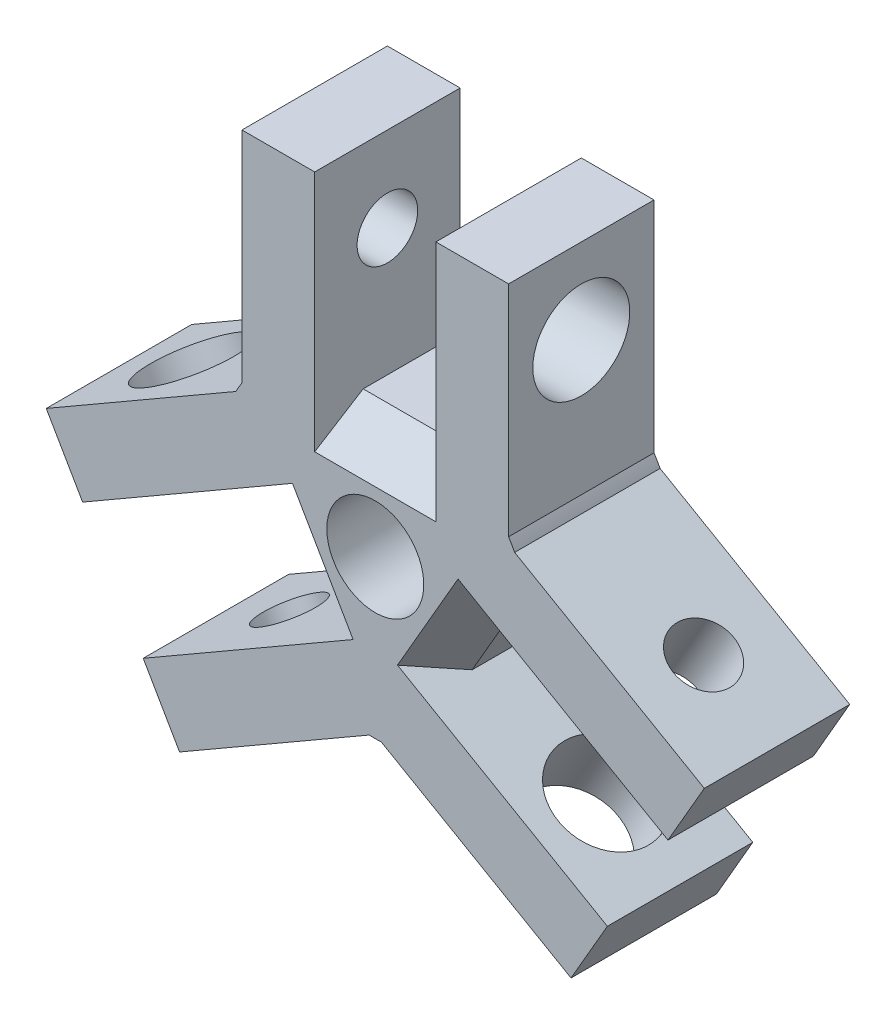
ISO-10303-21;
HEADER;
FILE_DESCRIPTION(('STEP AP214'),'2;1');
FILE_NAME('part.step','',(''),(''),'','','');
FILE_SCHEMA(('AUTOMOTIVE_DESIGN { 1 0 10303 214 1 1 1 1 }'));
ENDSEC;
DATA;
#1=APPLICATION_CONTEXT('core data for automotive mechanical design processes');
#2=APPLICATION_PROTOCOL_DEFINITION('international standard','automotive_design',2000,#1);
#3=PRODUCT_CONTEXT('',#1,'mechanical');
#4=PRODUCT('Part','Part','',(#3));
#5=PRODUCT_RELATED_PRODUCT_CATEGORY('part','',(#4));
#6=PRODUCT_DEFINITION_FORMATION('','',#4);
#7=PRODUCT_DEFINITION_CONTEXT('part definition',#1,'design');
#8=PRODUCT_DEFINITION('design','',#6,#7);
#9=PRODUCT_DEFINITION_SHAPE('','',#8);
#10=(LENGTH_UNIT() NAMED_UNIT(*) SI_UNIT(.MILLI.,.METRE.));
#11=(NAMED_UNIT(*) PLANE_ANGLE_UNIT() SI_UNIT($,.RADIAN.));
#12=(NAMED_UNIT(*) SI_UNIT($,.STERADIAN.) SOLID_ANGLE_UNIT());
#13=UNCERTAINTY_MEASURE_WITH_UNIT(LENGTH_MEASURE(1.E-05),#10,'distance_accuracy_value','');
#14=(GEOMETRIC_REPRESENTATION_CONTEXT(3) GLOBAL_UNCERTAINTY_ASSIGNED_CONTEXT((#13)) GLOBAL_UNIT_ASSIGNED_CONTEXT((#10,
#11,#12)) REPRESENTATION_CONTEXT('',''));
#15=CARTESIAN_POINT('',(0.,0.,0.));
#16=DIRECTION('',(0.,0.,1.));
#17=DIRECTION('',(1.,0.,0.));
#18=AXIS2_PLACEMENT_3D('',#15,#16,#17);
#19=CARTESIAN_POINT('',(0.,0.,6.));
#20=DIRECTION('',(0.,0.,1.));
#21=DIRECTION('',(1.,0.,0.));
#22=AXIS2_PLACEMENT_3D('',#19,#20,#21);
#23=PLANE('',#22);
#24=DIRECTION('',(-0.866025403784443,-0.499999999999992,0.));
#25=VECTOR('',#24,1.);
#26=CARTESIAN_POINT('',(-12.0753175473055,-4.08493649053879,6.));
#27=LINE('',#26,#25);
#28=CARTESIAN_POINT('',(-3.41506350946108,0.915063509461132,6.));
#29=VERTEX_POINT('',#28);
#30=CARTESIAN_POINT('',(-12.0753175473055,-4.08493649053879,6.));
#31=VERTEX_POINT('',#30);
#32=EDGE_CURVE('E53',#29,#31,#27,.T.);
#33=ORIENTED_EDGE('',*,*,#32,.F.);
#34=DIRECTION('',(0.499999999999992,-0.866025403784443,0.));
#35=VECTOR('',#34,1.);
#36=CARTESIAN_POINT('',(-2.1650635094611,-1.24999999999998,6.));
#37=LINE('',#36,#35);
#38=CARTESIAN_POINT('',(-0.915063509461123,-3.41506350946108,6.));
#39=VERTEX_POINT('',#38);
#40=EDGE_CURVE('E428',#29,#39,#37,.T.);
#41=ORIENTED_EDGE('',*,*,#40,.T.);
#42=DIRECTION('',(0.866025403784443,0.499999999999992,0.));
#43=VECTOR('',#42,1.);
#44=CARTESIAN_POINT('',(-9.57531754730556,-8.41506350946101,6.));
#45=LINE('',#44,#43);
#46=CARTESIAN_POINT('',(-9.57531754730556,-8.41506350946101,6.));
#47=VERTEX_POINT('',#46);
#48=EDGE_CURVE('E60',#47,#39,#45,.T.);
#49=ORIENTED_EDGE('',*,*,#48,.F.);
#50=DIRECTION('',(0.499999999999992,-0.866025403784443,0.));
#51=VECTOR('',#50,1.);
#52=CARTESIAN_POINT('',(-8.07531754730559,-11.0131397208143,6.));
#53=LINE('',#52,#51);
#54=CARTESIAN_POINT('',(-8.07531754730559,-11.0131397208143,6.));
#55=VERTEX_POINT('',#54);
#56=EDGE_CURVE('E280',#47,#55,#53,.T.);
#57=ORIENTED_EDGE('',*,*,#56,.T.);
#58=DIRECTION('',(0.866025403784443,0.499999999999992,0.));
#59=VECTOR('',#58,1.);
#60=CARTESIAN_POINT('',(-0.250000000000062,-6.49519052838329,6.));
#61=LINE('',#60,#59);
#62=CARTESIAN_POINT('',(-0.250000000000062,-6.49519052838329,6.));
#63=VERTEX_POINT('',#62);
#64=EDGE_CURVE('E293',#55,#63,#61,.T.);
#65=ORIENTED_EDGE('',*,*,#64,.T.);
#66=CARTESIAN_POINT('',(0.,0.,6.));
#67=DIRECTION('',(0.,0.,1.));
#68=DIRECTION('',(1.,0.,0.));
#69=AXIS2_PLACEMENT_3D('',#66,#67,#68);
#70=CIRCLE('',#69,6.5);
#71=CARTESIAN_POINT('',(0.249999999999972,-6.49519052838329,6.));
#72=VERTEX_POINT('',#71);
#73=EDGE_CURVE('E402',#63,#72,#70,.T.);
#74=ORIENTED_EDGE('',*,*,#73,.T.);
#75=DIRECTION('',(0.866025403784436,-0.500000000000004,0.));
#76=VECTOR('',#75,1.);
#77=CARTESIAN_POINT('',(0.249999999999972,-6.49519052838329,6.));
#78=LINE('',#77,#76);
#79=CARTESIAN_POINT('',(8.07531754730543,-11.0131397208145,6.));
#80=VERTEX_POINT('',#79);
#81=EDGE_CURVE('E316',#72,#80,#78,.T.);
#82=ORIENTED_EDGE('',*,*,#81,.T.);
#83=DIRECTION('',(0.500000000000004,0.866025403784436,0.));
#84=VECTOR('',#83,1.);
#85=CARTESIAN_POINT('',(13.5753175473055,-1.48686027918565,6.));
#86=LINE('',#85,#84);
#87=CARTESIAN_POINT('',(9.57531754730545,-8.41506350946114,6.));
#88=VERTEX_POINT('',#87);
#89=EDGE_CURVE('E322',#80,#88,#86,.T.);
#90=ORIENTED_EDGE('',*,*,#89,.T.);
#91=DIRECTION('',(0.866025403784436,-0.500000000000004,0.));
#92=VECTOR('',#91,1.);
#93=CARTESIAN_POINT('',(9.57531754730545,-8.41506350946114,6.));
#94=LINE('',#93,#92);
#95=CARTESIAN_POINT('',(0.915063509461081,-3.4150635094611,6.));
#96=VERTEX_POINT('',#95);
#97=EDGE_CURVE('E265',#96,#88,#94,.T.);
#98=ORIENTED_EDGE('',*,*,#97,.F.);
#99=DIRECTION('',(0.500000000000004,0.866025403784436,0.));
#100=VECTOR('',#99,1.);
#101=CARTESIAN_POINT('',(2.16506350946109,-1.25000000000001,6.));
#102=LINE('',#101,#100);
#103=CARTESIAN_POINT('',(3.4150635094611,0.915063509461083,6.));
#104=VERTEX_POINT('',#103);
#105=EDGE_CURVE('E418',#96,#104,#102,.T.);
#106=ORIENTED_EDGE('',*,*,#105,.T.);
#107=DIRECTION('',(-0.866025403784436,0.500000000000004,0.));
#108=VECTOR('',#107,1.);
#109=CARTESIAN_POINT('',(12.0753175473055,-4.08493649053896,6.));
#110=LINE('',#109,#108);
#111=CARTESIAN_POINT('',(12.0753175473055,-4.08493649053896,6.));
#112=VERTEX_POINT('',#111);
#113=EDGE_CURVE('E263',#112,#104,#110,.T.);
#114=ORIENTED_EDGE('',*,*,#113,.F.);
#115=CARTESIAN_POINT('',(13.5753175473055,-1.48686027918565,6.));
#116=VERTEX_POINT('',#115);
#117=EDGE_CURVE('E306',#112,#116,#86,.T.);
#118=ORIENTED_EDGE('',*,*,#117,.T.);
#119=DIRECTION('',(-0.866025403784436,0.500000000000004,0.));
#120=VECTOR('',#119,1.);
#121=CARTESIAN_POINT('',(5.75000000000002,3.03108891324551,6.));
#122=LINE('',#121,#120);
#123=CARTESIAN_POINT('',(5.75000000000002,3.03108891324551,6.));
#124=VERTEX_POINT('',#123);
#125=EDGE_CURVE('E320',#116,#124,#122,.T.);
#126=ORIENTED_EDGE('',*,*,#125,.T.);
#127=CARTESIAN_POINT('',(5.5,3.46410161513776,6.));
#128=VERTEX_POINT('',#127);
#129=EDGE_CURVE('E396',#124,#128,#70,.T.);
#130=ORIENTED_EDGE('',*,*,#129,.T.);
#131=DIRECTION('',(0.,1.,0.));
#132=VECTOR('',#131,1.);
#133=CARTESIAN_POINT('',(5.5,3.46410161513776,6.));
#134=LINE('',#133,#132);
#135=CARTESIAN_POINT('',(5.5,12.5,6.));
#136=VERTEX_POINT('',#135);
#137=EDGE_CURVE('E377',#128,#136,#134,.T.);
#138=ORIENTED_EDGE('',*,*,#137,.T.);
#139=DIRECTION('',(-1.,0.,0.));
#140=VECTOR('',#139,1.);
#141=CARTESIAN_POINT('',(-5.5,12.5,6.));
#142=LINE('',#141,#140);
#143=CARTESIAN_POINT('',(2.5,12.5,6.));
#144=VERTEX_POINT('',#143);
#145=EDGE_CURVE('E383',#136,#144,#142,.T.);
#146=ORIENTED_EDGE('',*,*,#145,.T.);
#147=DIRECTION('',(0.,1.,0.));
#148=VECTOR('',#147,1.);
#149=CARTESIAN_POINT('',(2.5,12.5,6.));
#150=LINE('',#149,#148);
#151=CARTESIAN_POINT('',(2.5,2.5,6.));
#152=VERTEX_POINT('',#151);
#153=EDGE_CURVE('E352',#152,#144,#150,.T.);
#154=ORIENTED_EDGE('',*,*,#153,.F.);
#155=DIRECTION('',(-1.,0.,0.));
#156=VECTOR('',#155,1.);
#157=CARTESIAN_POINT('',(0.,2.5,6.));
#158=LINE('',#157,#156);
#159=CARTESIAN_POINT('',(-2.5,2.5,6.));
#160=VERTEX_POINT('',#159);
#161=EDGE_CURVE('E405',#152,#160,#158,.T.);
#162=ORIENTED_EDGE('',*,*,#161,.T.);
#163=DIRECTION('',(0.,-1.,0.));
#164=VECTOR('',#163,1.);
#165=CARTESIAN_POINT('',(-2.5,12.5,6.));
#166=LINE('',#165,#164);
#167=CARTESIAN_POINT('',(-2.5,12.5,6.));
#168=VERTEX_POINT('',#167);
#169=EDGE_CURVE('E350',#168,#160,#166,.T.);
#170=ORIENTED_EDGE('',*,*,#169,.F.);
#171=CARTESIAN_POINT('',(-5.5,12.5,6.));
#172=VERTEX_POINT('',#171);
#173=EDGE_CURVE('E367',#168,#172,#142,.T.);
#174=ORIENTED_EDGE('',*,*,#173,.T.);
#175=DIRECTION('',(0.,-1.,0.));
#176=VECTOR('',#175,1.);
#177=CARTESIAN_POINT('',(-5.5,3.46410161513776,6.));
#178=LINE('',#177,#176);
#179=CARTESIAN_POINT('',(-5.5,3.46410161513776,6.));
#180=VERTEX_POINT('',#179);
#181=EDGE_CURVE('E381',#172,#180,#178,.T.);
#182=ORIENTED_EDGE('',*,*,#181,.T.);
#183=CARTESIAN_POINT('',(-5.74999999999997,3.03108891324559,6.));
#184=VERTEX_POINT('',#183);
#185=EDGE_CURVE('E398',#180,#184,#70,.T.);
#186=ORIENTED_EDGE('',*,*,#185,.T.);
#187=DIRECTION('',(-0.866025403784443,-0.499999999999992,0.));
#188=VECTOR('',#187,1.);
#189=CARTESIAN_POINT('',(-5.74999999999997,3.03108891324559,6.));
#190=LINE('',#189,#188);
#191=CARTESIAN_POINT('',(-13.5753175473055,-1.48686027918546,6.));
#192=VERTEX_POINT('',#191);
#193=EDGE_CURVE('E289',#184,#192,#190,.T.);
#194=ORIENTED_EDGE('',*,*,#193,.T.);
#195=EDGE_CURVE('E295',#192,#31,#53,.T.);
#196=ORIENTED_EDGE('',*,*,#195,.T.);
#197=EDGE_LOOP('',(#33,#41,#49,#57,#65,#74,#82,#90,#98,#106,#114,#118,#126,#130,#138,#146,#154,
#162,#170,#174,#182,#186,#194,#196));
#198=FACE_BOUND('',#197,.T.);
#199=CARTESIAN_POINT('',(0.,0.,6.));
#200=DIRECTION('',(0.,0.,-1.));
#201=DIRECTION('',(-1.,0.,0.));
#202=AXIS2_PLACEMENT_3D('',#199,#200,#201);
#203=CIRCLE('',#202,2.);
#204=CARTESIAN_POINT('',(-2.,0.,6.));
#205=VERTEX_POINT('',#204);
#206=EDGE_CURVE('E895',#205,#205,#203,.T.);
#207=ORIENTED_EDGE('',*,*,#206,.T.);
#208=EDGE_LOOP('',(#207));
#209=FACE_BOUND('',#208,.T.);
#210=ADVANCED_FACE('F36',(#198,#209),#23,.T.);
#211=CARTESIAN_POINT('',(-5.74999999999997,3.03108891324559,25.359866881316));
#212=DIRECTION('',(0.499999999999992,-0.866025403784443,0.));
#213=DIRECTION('',(0.866025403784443,0.499999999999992,0.));
#214=AXIS2_PLACEMENT_3D('',#211,#212,#213);
#215=PLANE('',#214);
#216=ORIENTED_EDGE('',*,*,#193,.F.);
#217=DIRECTION('',(0.,0.,-1.));
#218=VECTOR('',#217,1.);
#219=CARTESIAN_POINT('',(-5.74999999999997,3.03108891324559,25.359866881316));
#220=LINE('',#219,#218);
#221=CARTESIAN_POINT('',(-5.74999999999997,3.03108891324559,0.));
#222=VERTEX_POINT('',#221);
#223=EDGE_CURVE('E285',#184,#222,#220,.T.);
#224=ORIENTED_EDGE('',*,*,#223,.T.);
#225=DIRECTION('',(-0.866025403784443,-0.499999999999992,0.));
#226=VECTOR('',#225,1.);
#227=CARTESIAN_POINT('',(-5.74999999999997,3.03108891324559,0.));
#228=LINE('',#227,#226);
#229=CARTESIAN_POINT('',(-13.5753175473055,-1.48686027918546,0.));
#230=VERTEX_POINT('',#229);
#231=EDGE_CURVE('E281',#222,#230,#228,.T.);
#232=ORIENTED_EDGE('',*,*,#231,.T.);
#233=DIRECTION('',(0.,0.,-1.));
#234=VECTOR('',#233,1.);
#235=CARTESIAN_POINT('',(-13.5753175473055,-1.48686027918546,25.359866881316));
#236=LINE('',#235,#234);
#237=EDGE_CURVE('E284',#192,#230,#236,.T.);
#238=ORIENTED_EDGE('',*,*,#237,.F.);
#239=EDGE_LOOP('',(#216,#224,#232,#238));
#240=FACE_BOUND('',#239,.T.);
#241=CARTESIAN_POINT('',(-10.5442286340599,0.26313972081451,3.));
#242=DIRECTION('',(0.499999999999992,-0.866025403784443,0.));
#243=DIRECTION('',(0.866025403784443,0.499999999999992,0.));
#244=AXIS2_PLACEMENT_3D('',#241,#242,#243);
#245=CIRCLE('',#244,2.);
#246=CARTESIAN_POINT('',(-8.81217782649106,1.26313972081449,3.));
#247=VERTEX_POINT('',#246);
#248=EDGE_CURVE('E433',#247,#247,#245,.F.);
#249=ORIENTED_EDGE('',*,*,#248,.F.);
#250=EDGE_LOOP('',(#249));
#251=FACE_BOUND('',#250,.T.);
#252=ADVANCED_FACE('F520',(#240,#251),#215,.F.);
#253=CARTESIAN_POINT('',(-12.0753175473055,-4.08493649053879,6.));
#254=DIRECTION('',(0.499999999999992,-0.866025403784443,0.));
#255=DIRECTION('',(0.866025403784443,0.499999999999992,0.));
#256=AXIS2_PLACEMENT_3D('',#253,#254,#255);
#257=PLANE('',#256);
#258=DIRECTION('',(-0.866025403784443,-0.499999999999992,0.));
#259=VECTOR('',#258,1.);
#260=CARTESIAN_POINT('',(-12.0753175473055,-4.08493649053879,0.));
#261=LINE('',#260,#259);
#262=CARTESIAN_POINT('',(-4.49759526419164,0.290063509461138,0.));
#263=VERTEX_POINT('',#262);
#264=CARTESIAN_POINT('',(-12.0753175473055,-4.08493649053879,0.));
#265=VERTEX_POINT('',#264);
#266=EDGE_CURVE('E234',#263,#265,#261,.T.);
#267=ORIENTED_EDGE('',*,*,#266,.F.);
#268=DIRECTION('',(0.,0.,-1.));
#269=VECTOR('',#268,1.);
#270=CARTESIAN_POINT('',(-4.49759526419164,0.290063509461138,6.));
#271=LINE('',#270,#269);
#272=CARTESIAN_POINT('',(-4.49759526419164,0.290063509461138,3.99999999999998));
#273=VERTEX_POINT('',#272);
#274=EDGE_CURVE('E225',#273,#263,#271,.T.);
#275=ORIENTED_EDGE('',*,*,#274,.F.);
#276=DIRECTION('',(-0.458992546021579,-0.264999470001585,-0.847998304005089));
#277=VECTOR('',#276,1.);
#278=CARTESIAN_POINT('',(-4.49759526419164,0.290063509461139,3.99999999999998));
#279=LINE('',#278,#277);
#280=EDGE_CURVE('E45',#273,#29,#279,.F.);
#281=ORIENTED_EDGE('',*,*,#280,.T.);
#282=ORIENTED_EDGE('',*,*,#32,.T.);
#283=DIRECTION('',(0.,0.,-1.));
#284=VECTOR('',#283,1.);
#285=CARTESIAN_POINT('',(-12.0753175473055,-4.08493649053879,6.));
#286=LINE('',#285,#284);
#287=EDGE_CURVE('E252',#31,#265,#286,.T.);
#288=ORIENTED_EDGE('',*,*,#287,.T.);
#289=EDGE_LOOP('',(#267,#275,#281,#282,#288));
#290=FACE_BOUND('',#289,.T.);
#291=CARTESIAN_POINT('',(-9.04422863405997,-2.33493649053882,3.));
#292=DIRECTION('',(0.499999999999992,-0.866025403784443,0.));
#293=DIRECTION('',(0.866025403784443,0.499999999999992,0.));
#294=AXIS2_PLACEMENT_3D('',#291,#292,#293);
#295=CIRCLE('',#294,2.);
#296=CARTESIAN_POINT('',(-7.31217782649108,-1.33493649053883,3.));
#297=VERTEX_POINT('',#296);
#298=EDGE_CURVE('E40',#297,#297,#295,.F.);
#299=ORIENTED_EDGE('',*,*,#298,.T.);
#300=EDGE_LOOP('',(#299));
#301=FACE_BOUND('',#300,.T.);
#302=ADVANCED_FACE('F524',(#290,#301),#257,.T.);
#303=CARTESIAN_POINT('',(0.249999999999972,-6.49519052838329,25.359866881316));
#304=DIRECTION('',(0.500000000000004,0.866025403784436,0.));
#305=DIRECTION('',(-0.866025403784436,0.500000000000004,0.));
#306=AXIS2_PLACEMENT_3D('',#303,#304,#305);
#307=PLANE('',#306);
#308=ORIENTED_EDGE('',*,*,#81,.F.);
#309=DIRECTION('',(0.,0.,-1.));
#310=VECTOR('',#309,1.);
#311=CARTESIAN_POINT('',(0.249999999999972,-6.49519052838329,25.359866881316));
#312=LINE('',#311,#310);
#313=CARTESIAN_POINT('',(0.249999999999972,-6.49519052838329,0.));
#314=VERTEX_POINT('',#313);
#315=EDGE_CURVE('E312',#72,#314,#312,.T.);
#316=ORIENTED_EDGE('',*,*,#315,.T.);
#317=DIRECTION('',(0.866025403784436,-0.500000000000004,0.));
#318=VECTOR('',#317,1.);
#319=CARTESIAN_POINT('',(0.249999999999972,-6.49519052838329,0.));
#320=LINE('',#319,#318);
#321=CARTESIAN_POINT('',(8.07531754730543,-11.0131397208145,0.));
#322=VERTEX_POINT('',#321);
#323=EDGE_CURVE('E308',#314,#322,#320,.T.);
#324=ORIENTED_EDGE('',*,*,#323,.T.);
#325=DIRECTION('',(0.,0.,-1.));
#326=VECTOR('',#325,1.);
#327=CARTESIAN_POINT('',(8.07531754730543,-11.0131397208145,25.359866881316));
#328=LINE('',#327,#326);
#329=EDGE_CURVE('E311',#80,#322,#328,.T.);
#330=ORIENTED_EDGE('',*,*,#329,.F.);
#331=EDGE_LOOP('',(#308,#316,#324,#330));
#332=FACE_BOUND('',#331,.T.);
#333=CARTESIAN_POINT('',(5.04422863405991,-9.26313972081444,3.));
#334=DIRECTION('',(0.500000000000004,0.866025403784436,0.));
#335=DIRECTION('',(-0.866025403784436,0.500000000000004,0.));
#336=AXIS2_PLACEMENT_3D('',#333,#334,#335);
#337=CIRCLE('',#336,2.);
#338=CARTESIAN_POINT('',(3.31217782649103,-8.26313972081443,3.));
#339=VERTEX_POINT('',#338);
#340=EDGE_CURVE('E432',#339,#339,#337,.F.);
#341=ORIENTED_EDGE('',*,*,#340,.F.);
#342=EDGE_LOOP('',(#341));
#343=FACE_BOUND('',#342,.T.);
#344=ADVANCED_FACE('F491',(#332,#343),#307,.F.);
#345=CARTESIAN_POINT('',(9.57531754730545,-8.41506350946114,6.));
#346=DIRECTION('',(0.500000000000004,0.866025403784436,0.));
#347=DIRECTION('',(-0.866025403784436,0.500000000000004,0.));
#348=AXIS2_PLACEMENT_3D('',#345,#346,#347);
#349=PLANE('',#348);
#350=DIRECTION('',(0.866025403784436,-0.500000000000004,0.));
#351=VECTOR('',#350,1.);
#352=CARTESIAN_POINT('',(9.57531754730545,-8.41506350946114,0.));
#353=LINE('',#352,#351);
#354=CARTESIAN_POINT('',(1.99759526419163,-4.04006350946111,0.));
#355=VERTEX_POINT('',#354);
#356=CARTESIAN_POINT('',(9.57531754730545,-8.41506350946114,0.));
#357=VERTEX_POINT('',#356);
#358=EDGE_CURVE('E260',#355,#357,#353,.T.);
#359=ORIENTED_EDGE('',*,*,#358,.F.);
#360=DIRECTION('',(0.,0.,-1.));
#361=VECTOR('',#360,1.);
#362=CARTESIAN_POINT('',(1.99759526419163,-4.04006350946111,6.));
#363=LINE('',#362,#361);
#364=CARTESIAN_POINT('',(1.99759526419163,-4.04006350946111,3.99999999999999));
#365=VERTEX_POINT('',#364);
#366=EDGE_CURVE('E272',#365,#355,#363,.T.);
#367=ORIENTED_EDGE('',*,*,#366,.F.);
#368=DIRECTION('',(0.458992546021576,-0.264999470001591,-0.847998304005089));
#369=VECTOR('',#368,1.);
#370=CARTESIAN_POINT('',(1.99759526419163,-4.04006350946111,3.99999999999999));
#371=LINE('',#370,#369);
#372=EDGE_CURVE('E421',#365,#96,#371,.F.);
#373=ORIENTED_EDGE('',*,*,#372,.T.);
#374=ORIENTED_EDGE('',*,*,#97,.T.);
#375=DIRECTION('',(0.,0.,-1.));
#376=VECTOR('',#375,1.);
#377=CARTESIAN_POINT('',(9.57531754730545,-8.41506350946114,6.));
#378=LINE('',#377,#376);
#379=EDGE_CURVE('E270',#88,#357,#378,.T.);
#380=ORIENTED_EDGE('',*,*,#379,.T.);
#381=EDGE_LOOP('',(#359,#367,#373,#374,#380));
#382=FACE_BOUND('',#381,.T.);
#383=CARTESIAN_POINT('',(6.54422863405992,-6.66506350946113,3.));
#384=DIRECTION('',(0.500000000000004,0.866025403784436,0.));
#385=DIRECTION('',(-0.866025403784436,0.500000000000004,0.));
#386=AXIS2_PLACEMENT_3D('',#383,#384,#385);
#387=CIRCLE('',#386,2.);
#388=CARTESIAN_POINT('',(4.81217782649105,-5.66506350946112,3.));
#389=VERTEX_POINT('',#388);
#390=EDGE_CURVE('E430',#389,#389,#387,.F.);
#391=ORIENTED_EDGE('',*,*,#390,.T.);
#392=EDGE_LOOP('',(#391));
#393=FACE_BOUND('',#392,.T.);
#394=ADVANCED_FACE('F506',(#382,#393),#349,.T.);
#395=CARTESIAN_POINT('',(0.,0.,0.));
#396=DIRECTION('',(0.,0.,1.));
#397=DIRECTION('',(1.,0.,0.));
#398=AXIS2_PLACEMENT_3D('',#395,#396,#397);
#399=PLANE('',#398);
#400=CARTESIAN_POINT('',(0.,0.,0.));
#401=DIRECTION('',(0.,0.,-1.));
#402=DIRECTION('',(-1.,0.,0.));
#403=AXIS2_PLACEMENT_3D('',#400,#401,#402);
#404=CIRCLE('',#403,2.);
#405=CARTESIAN_POINT('',(-2.,0.,0.));
#406=VERTEX_POINT('',#405);
#407=EDGE_CURVE('E444',#406,#406,#404,.T.);
#408=ORIENTED_EDGE('',*,*,#407,.F.);
#409=EDGE_LOOP('',(#408));
#410=FACE_BOUND('',#409,.T.);
#411=DIRECTION('',(0.866025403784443,0.499999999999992,0.));
#412=VECTOR('',#411,1.);
#413=CARTESIAN_POINT('',(-9.57531754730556,-8.41506350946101,0.));
#414=LINE('',#413,#412);
#415=CARTESIAN_POINT('',(-9.57531754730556,-8.41506350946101,0.));
#416=VERTEX_POINT('',#415);
#417=CARTESIAN_POINT('',(-1.99759526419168,-4.04006350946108,0.));
#418=VERTEX_POINT('',#417);
#419=EDGE_CURVE('E218',#416,#418,#414,.T.);
#420=ORIENTED_EDGE('',*,*,#419,.T.);
#421=DIRECTION('',(-0.499999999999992,0.866025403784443,0.));
#422=VECTOR('',#421,1.);
#423=CARTESIAN_POINT('',(-1.99759526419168,-4.04006350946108,0.));
#424=LINE('',#423,#422);
#425=EDGE_CURVE('E228',#418,#263,#424,.T.);
#426=ORIENTED_EDGE('',*,*,#425,.T.);
#427=ORIENTED_EDGE('',*,*,#266,.T.);
#428=DIRECTION('',(0.499999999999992,-0.866025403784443,0.));
#429=VECTOR('',#428,1.);
#430=CARTESIAN_POINT('',(-8.07531754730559,-11.0131397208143,0.));
#431=LINE('',#430,#429);
#432=EDGE_CURVE('E277',#230,#265,#431,.T.);
#433=ORIENTED_EDGE('',*,*,#432,.F.);
#434=ORIENTED_EDGE('',*,*,#231,.F.);
#435=CARTESIAN_POINT('',(0.,0.,0.));
#436=DIRECTION('',(0.,0.,1.));
#437=DIRECTION('',(1.,0.,0.));
#438=AXIS2_PLACEMENT_3D('',#435,#436,#437);
#439=CIRCLE('',#438,6.5);
#440=CARTESIAN_POINT('',(-5.5,3.46410161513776,0.));
#441=VERTEX_POINT('',#440);
#442=EDGE_CURVE('E393',#441,#222,#439,.T.);
#443=ORIENTED_EDGE('',*,*,#442,.F.);
#444=DIRECTION('',(0.,-1.,0.));
#445=VECTOR('',#444,1.);
#446=CARTESIAN_POINT('',(-5.5,3.46410161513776,0.));
#447=LINE('',#446,#445);
#448=CARTESIAN_POINT('',(-5.5,12.5,0.));
#449=VERTEX_POINT('',#448);
#450=EDGE_CURVE('E374',#449,#441,#447,.T.);
#451=ORIENTED_EDGE('',*,*,#450,.F.);
#452=DIRECTION('',(-1.,0.,0.));
#453=VECTOR('',#452,1.);
#454=CARTESIAN_POINT('',(-5.5,12.5,0.));
#455=LINE('',#454,#453);
#456=CARTESIAN_POINT('',(-2.5,12.5,0.));
#457=VERTEX_POINT('',#456);
#458=EDGE_CURVE('E368',#457,#449,#455,.T.);
#459=ORIENTED_EDGE('',*,*,#458,.F.);
#460=DIRECTION('',(0.,-1.,0.));
#461=VECTOR('',#460,1.);
#462=CARTESIAN_POINT('',(-2.5,12.5,0.));
#463=LINE('',#462,#461);
#464=CARTESIAN_POINT('',(-2.5,3.75,0.));
#465=VERTEX_POINT('',#464);
#466=EDGE_CURVE('E341',#457,#465,#463,.T.);
#467=ORIENTED_EDGE('',*,*,#466,.T.);
#468=DIRECTION('',(1.,0.,0.));
#469=VECTOR('',#468,1.);
#470=CARTESIAN_POINT('',(-2.5,3.75,0.));
#471=LINE('',#470,#469);
#472=CARTESIAN_POINT('',(2.5,3.75,0.));
#473=VERTEX_POINT('',#472);
#474=EDGE_CURVE('E344',#465,#473,#471,.T.);
#475=ORIENTED_EDGE('',*,*,#474,.T.);
#476=DIRECTION('',(0.,1.,0.));
#477=VECTOR('',#476,1.);
#478=CARTESIAN_POINT('',(2.5,12.5,0.));
#479=LINE('',#478,#477);
#480=CARTESIAN_POINT('',(2.5,12.5,0.));
#481=VERTEX_POINT('',#480);
#482=EDGE_CURVE('E347',#473,#481,#479,.T.);
#483=ORIENTED_EDGE('',*,*,#482,.T.);
#484=CARTESIAN_POINT('',(5.5,12.5,0.));
#485=VERTEX_POINT('',#484);
#486=EDGE_CURVE('E364',#485,#481,#455,.T.);
#487=ORIENTED_EDGE('',*,*,#486,.F.);
#488=DIRECTION('',(0.,1.,0.));
#489=VECTOR('',#488,1.);
#490=CARTESIAN_POINT('',(5.5,3.46410161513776,0.));
#491=LINE('',#490,#489);
#492=CARTESIAN_POINT('',(5.5,3.46410161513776,0.));
#493=VERTEX_POINT('',#492);
#494=EDGE_CURVE('E369',#493,#485,#491,.T.);
#495=ORIENTED_EDGE('',*,*,#494,.F.);
#496=CARTESIAN_POINT('',(5.75000000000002,3.03108891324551,0.));
#497=VERTEX_POINT('',#496);
#498=EDGE_CURVE('E380',#497,#493,#439,.T.);
#499=ORIENTED_EDGE('',*,*,#498,.F.);
#500=DIRECTION('',(-0.866025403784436,0.500000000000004,0.));
#501=VECTOR('',#500,1.);
#502=CARTESIAN_POINT('',(5.75000000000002,3.03108891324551,0.));
#503=LINE('',#502,#501);
#504=CARTESIAN_POINT('',(13.5753175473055,-1.48686027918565,0.));
#505=VERTEX_POINT('',#504);
#506=EDGE_CURVE('E313',#505,#497,#503,.T.);
#507=ORIENTED_EDGE('',*,*,#506,.F.);
#508=DIRECTION('',(0.500000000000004,0.866025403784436,0.));
#509=VECTOR('',#508,1.);
#510=CARTESIAN_POINT('',(13.5753175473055,-1.48686027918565,0.));
#511=LINE('',#510,#509);
#512=CARTESIAN_POINT('',(12.0753175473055,-4.08493649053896,0.));
#513=VERTEX_POINT('',#512);
#514=EDGE_CURVE('E307',#513,#505,#511,.T.);
#515=ORIENTED_EDGE('',*,*,#514,.F.);
#516=DIRECTION('',(-0.866025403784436,0.500000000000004,0.));
#517=VECTOR('',#516,1.);
#518=CARTESIAN_POINT('',(12.0753175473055,-4.08493649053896,0.));
#519=LINE('',#518,#517);
#520=CARTESIAN_POINT('',(4.49759526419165,0.290063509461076,0.));
#521=VERTEX_POINT('',#520);
#522=EDGE_CURVE('E224',#513,#521,#519,.T.);
#523=ORIENTED_EDGE('',*,*,#522,.T.);
#524=DIRECTION('',(-0.500000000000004,-0.866025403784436,0.));
#525=VECTOR('',#524,1.);
#526=CARTESIAN_POINT('',(4.49759526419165,0.290063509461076,0.));
#527=LINE('',#526,#525);
#528=EDGE_CURVE('E257',#521,#355,#527,.T.);
#529=ORIENTED_EDGE('',*,*,#528,.T.);
#530=ORIENTED_EDGE('',*,*,#358,.T.);
#531=EDGE_CURVE('E303',#322,#357,#511,.T.);
#532=ORIENTED_EDGE('',*,*,#531,.F.);
#533=ORIENTED_EDGE('',*,*,#323,.F.);
#534=CARTESIAN_POINT('',(-0.250000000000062,-6.49519052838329,0.));
#535=VERTEX_POINT('',#534);
#536=EDGE_CURVE('E397',#535,#314,#439,.T.);
#537=ORIENTED_EDGE('',*,*,#536,.F.);
#538=DIRECTION('',(0.866025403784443,0.499999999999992,0.));
#539=VECTOR('',#538,1.);
#540=CARTESIAN_POINT('',(-0.250000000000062,-6.49519052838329,0.));
#541=LINE('',#540,#539);
#542=CARTESIAN_POINT('',(-8.07531754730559,-11.0131397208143,0.));
#543=VERTEX_POINT('',#542);
#544=EDGE_CURVE('E286',#543,#535,#541,.T.);
#545=ORIENTED_EDGE('',*,*,#544,.F.);
#546=EDGE_CURVE('E239',#416,#543,#431,.T.);
#547=ORIENTED_EDGE('',*,*,#546,.F.);
#548=EDGE_LOOP('',(#420,#426,#427,#433,#434,#443,#451,#459,#467,#475,#483,#487,#495,#499,#507,
#515,#523,#529,#530,#532,#533,#537,#545,#547));
#549=FACE_BOUND('',#548,.T.);
#550=ADVANCED_FACE('F237',(#410,#549),#399,.F.);
#551=CARTESIAN_POINT('',(-8.07531754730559,-11.0131397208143,25.359866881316));
#552=DIRECTION('',(0.866025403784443,0.499999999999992,0.));
#553=DIRECTION('',(-0.499999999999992,0.866025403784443,0.));
#554=AXIS2_PLACEMENT_3D('',#551,#552,#553);
#555=PLANE('',#554);
#556=DIRECTION('',(0.,0.,-1.));
#557=VECTOR('',#556,1.);
#558=CARTESIAN_POINT('',(-9.57531754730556,-8.41506350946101,6.));
#559=LINE('',#558,#557);
#560=EDGE_CURVE('E250',#47,#416,#559,.T.);
#561=ORIENTED_EDGE('',*,*,#560,.T.);
#562=ORIENTED_EDGE('',*,*,#546,.T.);
#563=DIRECTION('',(0.,0.,-1.));
#564=VECTOR('',#563,1.);
#565=CARTESIAN_POINT('',(-8.07531754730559,-11.0131397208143,25.359866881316));
#566=LINE('',#565,#564);
#567=EDGE_CURVE('E276',#55,#543,#566,.T.);
#568=ORIENTED_EDGE('',*,*,#567,.F.);
#569=ORIENTED_EDGE('',*,*,#56,.F.);
#570=EDGE_LOOP('',(#561,#562,#568,#569));
#571=FACE_BOUND('',#570,.T.);
#572=ADVANCED_FACE('F530',(#571),#555,.F.);
#573=ORIENTED_EDGE('',*,*,#287,.F.);
#574=ORIENTED_EDGE('',*,*,#195,.F.);
#575=ORIENTED_EDGE('',*,*,#237,.T.);
#576=ORIENTED_EDGE('',*,*,#432,.T.);
#577=EDGE_LOOP('',(#573,#574,#575,#576));
#578=FACE_BOUND('',#577,.T.);
#579=ADVANCED_FACE('F576',(#578),#555,.F.);
#580=CARTESIAN_POINT('',(13.5753175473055,-1.48686027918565,25.359866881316));
#581=DIRECTION('',(-0.866025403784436,0.500000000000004,0.));
#582=DIRECTION('',(-0.500000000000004,-0.866025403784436,0.));
#583=AXIS2_PLACEMENT_3D('',#580,#581,#582);
#584=PLANE('',#583);
#585=DIRECTION('',(0.,0.,-1.));
#586=VECTOR('',#585,1.);
#587=CARTESIAN_POINT('',(12.0753175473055,-4.08493649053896,6.));
#588=LINE('',#587,#586);
#589=EDGE_CURVE('E267',#112,#513,#588,.T.);
#590=ORIENTED_EDGE('',*,*,#589,.T.);
#591=ORIENTED_EDGE('',*,*,#514,.T.);
#592=DIRECTION('',(0.,0.,-1.));
#593=VECTOR('',#592,1.);
#594=CARTESIAN_POINT('',(13.5753175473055,-1.48686027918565,25.359866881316));
#595=LINE('',#594,#593);
#596=EDGE_CURVE('E292',#116,#505,#595,.T.);
#597=ORIENTED_EDGE('',*,*,#596,.F.);
#598=ORIENTED_EDGE('',*,*,#117,.F.);
#599=EDGE_LOOP('',(#590,#591,#597,#598));
#600=FACE_BOUND('',#599,.T.);
#601=ADVANCED_FACE('F470',(#600),#584,.F.);
#602=ORIENTED_EDGE('',*,*,#379,.F.);
#603=ORIENTED_EDGE('',*,*,#89,.F.);
#604=ORIENTED_EDGE('',*,*,#329,.T.);
#605=ORIENTED_EDGE('',*,*,#531,.T.);
#606=EDGE_LOOP('',(#602,#603,#604,#605));
#607=FACE_BOUND('',#606,.T.);
#608=ADVANCED_FACE('F501',(#607),#584,.F.);
#609=CARTESIAN_POINT('',(0.,0.,6.));
#610=DIRECTION('',(0.,0.,-1.));
#611=DIRECTION('',(-1.,0.,0.));
#612=AXIS2_PLACEMENT_3D('',#609,#610,#611);
#613=CYLINDRICAL_SURFACE('',#612,6.5);
#614=DIRECTION('',(0.,0.,-1.));
#615=VECTOR('',#614,1.);
#616=CARTESIAN_POINT('',(-0.250000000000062,-6.49519052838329,25.359866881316));
#617=LINE('',#616,#615);
#618=EDGE_CURVE('E288',#63,#535,#617,.T.);
#619=ORIENTED_EDGE('',*,*,#618,.T.);
#620=ORIENTED_EDGE('',*,*,#536,.T.);
#621=ORIENTED_EDGE('',*,*,#315,.F.);
#622=ORIENTED_EDGE('',*,*,#73,.F.);
#623=EDGE_LOOP('',(#619,#620,#621,#622));
#624=FACE_BOUND('',#623,.T.);
#625=ADVANCED_FACE('F495',(#624),#613,.T.);
#626=ORIENTED_EDGE('',*,*,#223,.F.);
#627=ORIENTED_EDGE('',*,*,#185,.F.);
#628=DIRECTION('',(0.,0.,-1.));
#629=VECTOR('',#628,1.);
#630=CARTESIAN_POINT('',(-5.5,3.46410161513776,20.2354297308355));
#631=LINE('',#630,#629);
#632=EDGE_CURVE('E376',#180,#441,#631,.T.);
#633=ORIENTED_EDGE('',*,*,#632,.T.);
#634=ORIENTED_EDGE('',*,*,#442,.T.);
#635=EDGE_LOOP('',(#626,#627,#633,#634));
#636=FACE_BOUND('',#635,.T.);
#637=ADVANCED_FACE('F602',(#636),#613,.T.);
#638=DIRECTION('',(0.,0.,-1.));
#639=VECTOR('',#638,1.);
#640=CARTESIAN_POINT('',(5.75000000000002,3.03108891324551,25.359866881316));
#641=LINE('',#640,#639);
#642=EDGE_CURVE('E315',#124,#497,#641,.T.);
#643=ORIENTED_EDGE('',*,*,#642,.T.);
#644=ORIENTED_EDGE('',*,*,#498,.T.);
#645=DIRECTION('',(0.,0.,-1.));
#646=VECTOR('',#645,1.);
#647=CARTESIAN_POINT('',(5.5,3.46410161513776,20.2354297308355));
#648=LINE('',#647,#646);
#649=EDGE_CURVE('E373',#128,#493,#648,.T.);
#650=ORIENTED_EDGE('',*,*,#649,.F.);
#651=ORIENTED_EDGE('',*,*,#129,.F.);
#652=EDGE_LOOP('',(#643,#644,#650,#651));
#653=FACE_BOUND('',#652,.T.);
#654=ADVANCED_FACE('F38',(#653),#613,.T.);
#655=CARTESIAN_POINT('',(5.5,3.46410161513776,20.2354297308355));
#656=DIRECTION('',(-1.,0.,0.));
#657=DIRECTION('',(0.,0.,1.));
#658=AXIS2_PLACEMENT_3D('',#655,#656,#657);
#659=PLANE('',#658);
#660=ORIENTED_EDGE('',*,*,#137,.F.);
#661=ORIENTED_EDGE('',*,*,#649,.T.);
#662=ORIENTED_EDGE('',*,*,#494,.T.);
#663=DIRECTION('',(0.,0.,-1.));
#664=VECTOR('',#663,1.);
#665=CARTESIAN_POINT('',(5.5,12.5,20.2354297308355));
#666=LINE('',#665,#664);
#667=EDGE_CURVE('E372',#136,#485,#666,.T.);
#668=ORIENTED_EDGE('',*,*,#667,.F.);
#669=EDGE_LOOP('',(#660,#661,#662,#668));
#670=FACE_BOUND('',#669,.T.);
#671=CARTESIAN_POINT('',(5.5,9.,3.));
#672=DIRECTION('',(-1.,0.,0.));
#673=DIRECTION('',(0.,0.,1.));
#674=AXIS2_PLACEMENT_3D('',#671,#672,#673);
#675=CIRCLE('',#674,2.);
#676=CARTESIAN_POINT('',(5.5,9.,5.));
#677=VERTEX_POINT('',#676);
#678=EDGE_CURVE('E332',#677,#677,#675,.F.);
#679=ORIENTED_EDGE('',*,*,#678,.F.);
#680=EDGE_LOOP('',(#679));
#681=FACE_BOUND('',#680,.T.);
#682=ADVANCED_FACE('F538',(#670,#681),#659,.F.);
#683=CARTESIAN_POINT('',(2.5,12.5,6.));
#684=DIRECTION('',(-1.,0.,0.));
#685=DIRECTION('',(0.,-1.,0.));
#686=AXIS2_PLACEMENT_3D('',#683,#684,#685);
#687=PLANE('',#686);
#688=ORIENTED_EDGE('',*,*,#482,.F.);
#689=DIRECTION('',(0.,0.,-1.));
#690=VECTOR('',#689,1.);
#691=CARTESIAN_POINT('',(2.5,3.75,6.));
#692=LINE('',#691,#690);
#693=CARTESIAN_POINT('',(2.5,3.75,3.99999999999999));
#694=VERTEX_POINT('',#693);
#695=EDGE_CURVE('E359',#694,#473,#692,.T.);
#696=ORIENTED_EDGE('',*,*,#695,.F.);
#697=DIRECTION('',(0.,0.529998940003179,-0.847998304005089));
#698=VECTOR('',#697,1.);
#699=CARTESIAN_POINT('',(2.5,3.75,3.99999999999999));
#700=LINE('',#699,#698);
#701=EDGE_CURVE('E408',#694,#152,#700,.F.);
#702=ORIENTED_EDGE('',*,*,#701,.T.);
#703=ORIENTED_EDGE('',*,*,#153,.T.);
#704=DIRECTION('',(0.,0.,-1.));
#705=VECTOR('',#704,1.);
#706=CARTESIAN_POINT('',(2.5,12.5,6.));
#707=LINE('',#706,#705);
#708=EDGE_CURVE('E357',#144,#481,#707,.T.);
#709=ORIENTED_EDGE('',*,*,#708,.T.);
#710=EDGE_LOOP('',(#688,#696,#702,#703,#709));
#711=FACE_BOUND('',#710,.T.);
#712=CARTESIAN_POINT('',(2.5,9.,3.));
#713=DIRECTION('',(-1.,0.,0.));
#714=DIRECTION('',(0.,-1.,0.));
#715=AXIS2_PLACEMENT_3D('',#712,#713,#714);
#716=CIRCLE('',#715,2.);
#717=CARTESIAN_POINT('',(2.5,7.,3.));
#718=VERTEX_POINT('',#717);
#719=EDGE_CURVE('E319',#718,#718,#716,.F.);
#720=ORIENTED_EDGE('',*,*,#719,.T.);
#721=EDGE_LOOP('',(#720));
#722=FACE_BOUND('',#721,.T.);
#723=ADVANCED_FACE('F541',(#711,#722),#687,.T.);
#724=CARTESIAN_POINT('',(-5.5,12.5,20.2354297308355));
#725=DIRECTION('',(0.,-1.,0.));
#726=DIRECTION('',(0.,0.,-1.));
#727=AXIS2_PLACEMENT_3D('',#724,#725,#726);
#728=PLANE('',#727);
#729=DIRECTION('',(0.,0.,-1.));
#730=VECTOR('',#729,1.);
#731=CARTESIAN_POINT('',(-2.5,12.5,6.));
#732=LINE('',#731,#730);
#733=EDGE_CURVE('E354',#168,#457,#732,.T.);
#734=ORIENTED_EDGE('',*,*,#733,.T.);
#735=ORIENTED_EDGE('',*,*,#458,.T.);
#736=DIRECTION('',(0.,0.,-1.));
#737=VECTOR('',#736,1.);
#738=CARTESIAN_POINT('',(-5.5,12.5,20.2354297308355));
#739=LINE('',#738,#737);
#740=EDGE_CURVE('E363',#172,#449,#739,.T.);
#741=ORIENTED_EDGE('',*,*,#740,.F.);
#742=ORIENTED_EDGE('',*,*,#173,.F.);
#743=EDGE_LOOP('',(#734,#735,#741,#742));
#744=FACE_BOUND('',#743,.T.);
#745=ADVANCED_FACE('F543',(#744),#728,.F.);
#746=ORIENTED_EDGE('',*,*,#708,.F.);
#747=ORIENTED_EDGE('',*,*,#145,.F.);
#748=ORIENTED_EDGE('',*,*,#667,.T.);
#749=ORIENTED_EDGE('',*,*,#486,.T.);
#750=EDGE_LOOP('',(#746,#747,#748,#749));
#751=FACE_BOUND('',#750,.T.);
#752=ADVANCED_FACE('F536',(#751),#728,.F.);
#753=CARTESIAN_POINT('',(-5.5,3.46410161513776,20.2354297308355));
#754=DIRECTION('',(1.,0.,0.));
#755=DIRECTION('',(0.,0.,-1.));
#756=AXIS2_PLACEMENT_3D('',#753,#754,#755);
#757=PLANE('',#756);
#758=CARTESIAN_POINT('',(-5.5,9.,3.));
#759=DIRECTION('',(1.,0.,0.));
#760=DIRECTION('',(0.,0.,-1.));
#761=AXIS2_PLACEMENT_3D('',#758,#759,#760);
#762=CIRCLE('',#761,1.25);
#763=CARTESIAN_POINT('',(-5.5,9.,1.75));
#764=VERTEX_POINT('',#763);
#765=EDGE_CURVE('E338',#764,#764,#762,.T.);
#766=ORIENTED_EDGE('',*,*,#765,.T.);
#767=EDGE_LOOP('',(#766));
#768=FACE_BOUND('',#767,.T.);
#769=ORIENTED_EDGE('',*,*,#181,.F.);
#770=ORIENTED_EDGE('',*,*,#740,.T.);
#771=ORIENTED_EDGE('',*,*,#450,.T.);
#772=ORIENTED_EDGE('',*,*,#632,.F.);
#773=EDGE_LOOP('',(#769,#770,#771,#772));
#774=FACE_BOUND('',#773,.T.);
#775=ADVANCED_FACE('F532',(#768,#774),#757,.F.);
#776=CARTESIAN_POINT('',(-2.5,12.5,6.));
#777=DIRECTION('',(1.,0.,0.));
#778=DIRECTION('',(0.,1.,0.));
#779=AXIS2_PLACEMENT_3D('',#776,#777,#778);
#780=PLANE('',#779);
#781=CARTESIAN_POINT('',(-2.5,9.,3.));
#782=DIRECTION('',(1.,0.,0.));
#783=DIRECTION('',(0.,1.,0.));
#784=AXIS2_PLACEMENT_3D('',#781,#782,#783);
#785=CIRCLE('',#784,1.25);
#786=CARTESIAN_POINT('',(-2.5,10.25,3.));
#787=VERTEX_POINT('',#786);
#788=EDGE_CURVE('E335',#787,#787,#785,.T.);
#789=ORIENTED_EDGE('',*,*,#788,.F.);
#790=EDGE_LOOP('',(#789));
#791=FACE_BOUND('',#790,.T.);
#792=ORIENTED_EDGE('',*,*,#466,.F.);
#793=ORIENTED_EDGE('',*,*,#733,.F.);
#794=ORIENTED_EDGE('',*,*,#169,.T.);
#795=DIRECTION('',(0.,-0.529998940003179,0.847998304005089));
#796=VECTOR('',#795,1.);
#797=CARTESIAN_POINT('',(-2.5,3.75,3.99999999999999));
#798=LINE('',#797,#796);
#799=CARTESIAN_POINT('',(-2.5,3.75,3.99999999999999));
#800=VERTEX_POINT('',#799);
#801=EDGE_CURVE('E411',#160,#800,#798,.F.);
#802=ORIENTED_EDGE('',*,*,#801,.T.);
#803=DIRECTION('',(0.,0.,-1.));
#804=VECTOR('',#803,1.);
#805=CARTESIAN_POINT('',(-2.5,3.75,6.));
#806=LINE('',#805,#804);
#807=EDGE_CURVE('E361',#800,#465,#806,.T.);
#808=ORIENTED_EDGE('',*,*,#807,.T.);
#809=EDGE_LOOP('',(#792,#793,#794,#802,#808));
#810=FACE_BOUND('',#809,.T.);
#811=ADVANCED_FACE('F535',(#791,#810),#780,.T.);
#812=CARTESIAN_POINT('',(-2.5,3.75,6.));
#813=DIRECTION('',(0.,1.,0.));
#814=DIRECTION('',(-1.,0.,0.));
#815=AXIS2_PLACEMENT_3D('',#812,#813,#814);
#816=PLANE('',#815);
#817=ORIENTED_EDGE('',*,*,#807,.F.);
#818=DIRECTION('',(1.,0.,0.));
#819=VECTOR('',#818,1.);
#820=CARTESIAN_POINT('',(-2.5,3.75,3.99999999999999));
#821=LINE('',#820,#819);
#822=EDGE_CURVE('E401',#800,#694,#821,.T.);
#823=ORIENTED_EDGE('',*,*,#822,.T.);
#824=ORIENTED_EDGE('',*,*,#695,.T.);
#825=ORIENTED_EDGE('',*,*,#474,.F.);
#826=EDGE_LOOP('',(#817,#823,#824,#825));
#827=FACE_BOUND('',#826,.T.);
#828=ADVANCED_FACE('F549',(#827),#816,.T.);
#829=CARTESIAN_POINT('',(-2.5,3.75,3.99999999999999));
#830=DIRECTION('',(0.,-0.847998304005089,-0.529998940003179));
#831=DIRECTION('',(0.,0.529998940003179,-0.847998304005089));
#832=AXIS2_PLACEMENT_3D('',#829,#830,#831);
#833=PLANE('',#832);
#834=ORIENTED_EDGE('',*,*,#801,.F.);
#835=ORIENTED_EDGE('',*,*,#161,.F.);
#836=ORIENTED_EDGE('',*,*,#701,.F.);
#837=ORIENTED_EDGE('',*,*,#822,.F.);
#838=EDGE_LOOP('',(#834,#835,#836,#837));
#839=FACE_BOUND('',#838,.T.);
#840=ADVANCED_FACE('F553',(#839),#833,.F.);
#841=CARTESIAN_POINT('',(-6.5,9.,3.));
#842=DIRECTION('',(1.,0.,0.));
#843=DIRECTION('',(0.,1.,0.));
#844=AXIS2_PLACEMENT_3D('',#841,#842,#843);
#845=CYLINDRICAL_SURFACE('',#844,1.25);
#846=ORIENTED_EDGE('',*,*,#788,.T.);
#847=EDGE_LOOP('',(#846));
#848=FACE_BOUND('',#847,.T.);
#849=ORIENTED_EDGE('',*,*,#765,.F.);
#850=EDGE_LOOP('',(#849));
#851=FACE_BOUND('',#850,.T.);
#852=ADVANCED_FACE('F560',(#848,#851),#845,.F.);
#853=CARTESIAN_POINT('',(6.5,9.,3.));
#854=DIRECTION('',(-1.,0.,0.));
#855=DIRECTION('',(0.,-1.,0.));
#856=AXIS2_PLACEMENT_3D('',#853,#854,#855);
#857=CYLINDRICAL_SURFACE('',#856,2.);
#858=ORIENTED_EDGE('',*,*,#719,.F.);
#859=EDGE_LOOP('',(#858));
#860=FACE_BOUND('',#859,.T.);
#861=ORIENTED_EDGE('',*,*,#678,.T.);
#862=EDGE_LOOP('',(#861));
#863=FACE_BOUND('',#862,.T.);
#864=ADVANCED_FACE('F564',(#860,#863),#857,.F.);
#865=CARTESIAN_POINT('',(5.75000000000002,3.03108891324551,25.359866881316));
#866=DIRECTION('',(-0.500000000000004,-0.866025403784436,0.));
#867=DIRECTION('',(0.866025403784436,-0.500000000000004,0.));
#868=AXIS2_PLACEMENT_3D('',#865,#866,#867);
#869=PLANE('',#868);
#870=CARTESIAN_POINT('',(10.54422863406,0.263139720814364,3.));
#871=DIRECTION('',(-0.500000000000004,-0.866025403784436,0.));
#872=DIRECTION('',(0.866025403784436,-0.500000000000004,0.));
#873=AXIS2_PLACEMENT_3D('',#870,#871,#872);
#874=CIRCLE('',#873,1.25);
#875=CARTESIAN_POINT('',(11.6267603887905,-0.361860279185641,3.));
#876=VERTEX_POINT('',#875);
#877=EDGE_CURVE('E240',#876,#876,#874,.T.);
#878=ORIENTED_EDGE('',*,*,#877,.T.);
#879=EDGE_LOOP('',(#878));
#880=FACE_BOUND('',#879,.T.);
#881=ORIENTED_EDGE('',*,*,#125,.F.);
#882=ORIENTED_EDGE('',*,*,#596,.T.);
#883=ORIENTED_EDGE('',*,*,#506,.T.);
#884=ORIENTED_EDGE('',*,*,#642,.F.);
#885=EDGE_LOOP('',(#881,#882,#883,#884));
#886=FACE_BOUND('',#885,.T.);
#887=ADVANCED_FACE('F478',(#880,#886),#869,.F.);
#888=CARTESIAN_POINT('',(-0.250000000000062,-6.49519052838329,25.359866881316));
#889=DIRECTION('',(-0.499999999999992,0.866025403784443,0.));
#890=DIRECTION('',(-0.866025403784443,-0.499999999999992,0.));
#891=AXIS2_PLACEMENT_3D('',#888,#889,#890);
#892=PLANE('',#891);
#893=CARTESIAN_POINT('',(-5.04422863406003,-9.26313972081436,3.));
#894=DIRECTION('',(-0.499999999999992,0.866025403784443,0.));
#895=DIRECTION('',(-0.866025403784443,-0.499999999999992,0.));
#896=AXIS2_PLACEMENT_3D('',#893,#894,#895);
#897=CIRCLE('',#896,1.25);
#898=CARTESIAN_POINT('',(-6.12676038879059,-9.88813972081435,3.));
#899=VERTEX_POINT('',#898);
#900=EDGE_CURVE('E450',#899,#899,#897,.T.);
#901=ORIENTED_EDGE('',*,*,#900,.T.);
#902=EDGE_LOOP('',(#901));
#903=FACE_BOUND('',#902,.T.);
#904=ORIENTED_EDGE('',*,*,#64,.F.);
#905=ORIENTED_EDGE('',*,*,#567,.T.);
#906=ORIENTED_EDGE('',*,*,#544,.T.);
#907=ORIENTED_EDGE('',*,*,#618,.F.);
#908=EDGE_LOOP('',(#904,#905,#906,#907));
#909=FACE_BOUND('',#908,.T.);
#910=ADVANCED_FACE('F462',(#903,#909),#892,.F.);
#911=CARTESIAN_POINT('',(12.0753175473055,-4.08493649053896,6.));
#912=DIRECTION('',(-0.500000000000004,-0.866025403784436,0.));
#913=DIRECTION('',(0.866025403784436,-0.500000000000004,0.));
#914=AXIS2_PLACEMENT_3D('',#911,#912,#913);
#915=PLANE('',#914);
#916=CARTESIAN_POINT('',(9.04422863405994,-2.33493649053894,3.));
#917=DIRECTION('',(-0.500000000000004,-0.866025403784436,0.));
#918=DIRECTION('',(0.866025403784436,-0.500000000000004,0.));
#919=AXIS2_PLACEMENT_3D('',#916,#917,#918);
#920=CIRCLE('',#919,1.25);
#921=CARTESIAN_POINT('',(10.1267603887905,-2.95993649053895,3.));
#922=VERTEX_POINT('',#921);
#923=EDGE_CURVE('E243',#922,#922,#920,.T.);
#924=ORIENTED_EDGE('',*,*,#923,.F.);
#925=EDGE_LOOP('',(#924));
#926=FACE_BOUND('',#925,.T.);
#927=ORIENTED_EDGE('',*,*,#522,.F.);
#928=ORIENTED_EDGE('',*,*,#589,.F.);
#929=ORIENTED_EDGE('',*,*,#113,.T.);
#930=DIRECTION('',(-0.458992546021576,0.264999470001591,0.847998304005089));
#931=VECTOR('',#930,1.);
#932=CARTESIAN_POINT('',(4.49759526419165,0.290063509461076,3.99999999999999));
#933=LINE('',#932,#931);
#934=CARTESIAN_POINT('',(4.49759526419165,0.290063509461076,3.99999999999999));
#935=VERTEX_POINT('',#934);
#936=EDGE_CURVE('E424',#104,#935,#933,.F.);
#937=ORIENTED_EDGE('',*,*,#936,.T.);
#938=DIRECTION('',(0.,0.,-1.));
#939=VECTOR('',#938,1.);
#940=CARTESIAN_POINT('',(4.49759526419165,0.290063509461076,6.));
#941=LINE('',#940,#939);
#942=EDGE_CURVE('E274',#935,#521,#941,.T.);
#943=ORIENTED_EDGE('',*,*,#942,.T.);
#944=EDGE_LOOP('',(#927,#928,#929,#937,#943));
#945=FACE_BOUND('',#944,.T.);
#946=ADVANCED_FACE('F458',(#926,#945),#915,.T.);
#947=CARTESIAN_POINT('',(4.49759526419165,0.290063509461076,6.));
#948=DIRECTION('',(0.866025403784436,-0.500000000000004,0.));
#949=DIRECTION('',(0.500000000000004,0.866025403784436,0.));
#950=AXIS2_PLACEMENT_3D('',#947,#948,#949);
#951=PLANE('',#950);
#952=ORIENTED_EDGE('',*,*,#942,.F.);
#953=DIRECTION('',(-0.500000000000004,-0.866025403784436,0.));
#954=VECTOR('',#953,1.);
#955=CARTESIAN_POINT('',(4.49759526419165,0.290063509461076,3.99999999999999));
#956=LINE('',#955,#954);
#957=EDGE_CURVE('E413',#935,#365,#956,.T.);
#958=ORIENTED_EDGE('',*,*,#957,.T.);
#959=ORIENTED_EDGE('',*,*,#366,.T.);
#960=ORIENTED_EDGE('',*,*,#528,.F.);
#961=EDGE_LOOP('',(#952,#958,#959,#960));
#962=FACE_BOUND('',#961,.T.);
#963=ADVANCED_FACE('F461',(#962),#951,.T.);
#964=CARTESIAN_POINT('',(-9.57531754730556,-8.41506350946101,6.));
#965=DIRECTION('',(-0.499999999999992,0.866025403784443,0.));
#966=DIRECTION('',(-0.866025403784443,-0.499999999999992,0.));
#967=AXIS2_PLACEMENT_3D('',#964,#965,#966);
#968=PLANE('',#967);
#969=CARTESIAN_POINT('',(-6.54422863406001,-6.66506350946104,3.));
#970=DIRECTION('',(-0.499999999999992,0.866025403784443,0.));
#971=DIRECTION('',(-0.866025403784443,-0.499999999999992,0.));
#972=AXIS2_PLACEMENT_3D('',#969,#970,#971);
#973=CIRCLE('',#972,1.25);
#974=CARTESIAN_POINT('',(-7.62676038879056,-7.29006350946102,3.));
#975=VERTEX_POINT('',#974);
#976=EDGE_CURVE('E437',#975,#975,#973,.T.);
#977=ORIENTED_EDGE('',*,*,#976,.F.);
#978=EDGE_LOOP('',(#977));
#979=FACE_BOUND('',#978,.T.);
#980=ORIENTED_EDGE('',*,*,#419,.F.);
#981=ORIENTED_EDGE('',*,*,#560,.F.);
#982=ORIENTED_EDGE('',*,*,#48,.T.);
#983=DIRECTION('',(0.458992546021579,0.264999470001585,0.847998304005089));
#984=VECTOR('',#983,1.);
#985=CARTESIAN_POINT('',(-1.99759526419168,-4.04006350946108,3.99999999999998));
#986=LINE('',#985,#984);
#987=CARTESIAN_POINT('',(-1.99759526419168,-4.04006350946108,3.99999999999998));
#988=VERTEX_POINT('',#987);
#989=EDGE_CURVE('E11',#39,#988,#986,.F.);
#990=ORIENTED_EDGE('',*,*,#989,.T.);
#991=DIRECTION('',(0.,0.,-1.));
#992=VECTOR('',#991,1.);
#993=CARTESIAN_POINT('',(-1.99759526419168,-4.04006350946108,6.));
#994=LINE('',#993,#992);
#995=EDGE_CURVE('E214',#988,#418,#994,.T.);
#996=ORIENTED_EDGE('',*,*,#995,.T.);
#997=EDGE_LOOP('',(#980,#981,#982,#990,#996));
#998=FACE_BOUND('',#997,.T.);
#999=ADVANCED_FACE('F216',(#979,#998),#968,.T.);
#1000=CARTESIAN_POINT('',(-1.99759526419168,-4.04006350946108,6.));
#1001=DIRECTION('',(-0.866025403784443,-0.499999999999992,0.));
#1002=DIRECTION('',(0.499999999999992,-0.866025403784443,0.));
#1003=AXIS2_PLACEMENT_3D('',#1000,#1001,#1002);
#1004=PLANE('',#1003);
#1005=ORIENTED_EDGE('',*,*,#995,.F.);
#1006=DIRECTION('',(-0.499999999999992,0.866025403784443,0.));
#1007=VECTOR('',#1006,1.);
#1008=CARTESIAN_POINT('',(-1.99759526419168,-4.04006350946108,3.99999999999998));
#1009=LINE('',#1008,#1007);
#1010=EDGE_CURVE('E426',#988,#273,#1009,.T.);
#1011=ORIENTED_EDGE('',*,*,#1010,.T.);
#1012=ORIENTED_EDGE('',*,*,#274,.T.);
#1013=ORIENTED_EDGE('',*,*,#425,.F.);
#1014=EDGE_LOOP('',(#1005,#1011,#1012,#1013));
#1015=FACE_BOUND('',#1014,.T.);
#1016=ADVANCED_FACE('F229',(#1015),#1004,.T.);
#1017=CARTESIAN_POINT('',(4.49759526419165,0.290063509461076,3.99999999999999));
#1018=DIRECTION('',(-0.734388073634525,0.423999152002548,-0.529998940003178));
#1019=DIRECTION('',(-0.585205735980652,0.,0.810884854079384));
#1020=AXIS2_PLACEMENT_3D('',#1017,#1018,#1019);
#1021=PLANE('',#1020);
#1022=ORIENTED_EDGE('',*,*,#936,.F.);
#1023=ORIENTED_EDGE('',*,*,#105,.F.);
#1024=ORIENTED_EDGE('',*,*,#372,.F.);
#1025=ORIENTED_EDGE('',*,*,#957,.F.);
#1026=EDGE_LOOP('',(#1022,#1023,#1024,#1025));
#1027=FACE_BOUND('',#1026,.T.);
#1028=ADVANCED_FACE('F509',(#1027),#1021,.F.);
#1029=CARTESIAN_POINT('',(-1.99759526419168,-4.04006350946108,3.99999999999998));
#1030=DIRECTION('',(0.734388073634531,0.423999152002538,-0.529998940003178));
#1031=DIRECTION('',(-0.585205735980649,0.,-0.810884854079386));
#1032=AXIS2_PLACEMENT_3D('',#1029,#1030,#1031);
#1033=PLANE('',#1032);
#1034=ORIENTED_EDGE('',*,*,#989,.F.);
#1035=ORIENTED_EDGE('',*,*,#40,.F.);
#1036=ORIENTED_EDGE('',*,*,#280,.F.);
#1037=ORIENTED_EDGE('',*,*,#1010,.F.);
#1038=EDGE_LOOP('',(#1034,#1035,#1036,#1037));
#1039=FACE_BOUND('',#1038,.T.);
#1040=ADVANCED_FACE('F590',(#1039),#1033,.F.);
#1041=CARTESIAN_POINT('',(0.368430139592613,-18.6381397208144,3.));
#1042=DIRECTION('',(-0.499999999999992,0.866025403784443,0.));
#1043=DIRECTION('',(-0.866025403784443,-0.499999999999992,0.));
#1044=AXIS2_PLACEMENT_3D('',#1041,#1042,#1043);
#1045=CYLINDRICAL_SURFACE('',#1044,1.25);
#1046=ORIENTED_EDGE('',*,*,#976,.T.);
#1047=EDGE_LOOP('',(#1046));
#1048=FACE_BOUND('',#1047,.T.);
#1049=ORIENTED_EDGE('',*,*,#900,.F.);
#1050=EDGE_LOOP('',(#1049));
#1051=FACE_BOUND('',#1050,.T.);
#1052=ADVANCED_FACE('F708',(#1048,#1051),#1045,.F.);
#1053=CARTESIAN_POINT('',(16.6007167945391,10.7532849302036,3.));
#1054=DIRECTION('',(-0.500000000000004,-0.866025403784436,0.));
#1055=DIRECTION('',(0.866025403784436,-0.500000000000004,0.));
#1056=AXIS2_PLACEMENT_3D('',#1053,#1054,#1055);
#1057=CYLINDRICAL_SURFACE('',#1056,1.25);
#1058=ORIENTED_EDGE('',*,*,#923,.T.);
#1059=EDGE_LOOP('',(#1058));
#1060=FACE_BOUND('',#1059,.T.);
#1061=ORIENTED_EDGE('',*,*,#877,.F.);
#1062=EDGE_LOOP('',(#1061));
#1063=FACE_BOUND('',#1062,.T.);
#1064=ADVANCED_FACE('F455',(#1060,#1063),#1057,.F.);
#1065=CARTESIAN_POINT('',(-0.368430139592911,-18.6381397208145,3.));
#1066=DIRECTION('',(0.500000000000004,0.866025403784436,0.));
#1067=DIRECTION('',(-0.866025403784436,0.500000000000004,0.));
#1068=AXIS2_PLACEMENT_3D('',#1065,#1066,#1067);
#1069=CYLINDRICAL_SURFACE('',#1068,2.);
#1070=ORIENTED_EDGE('',*,*,#390,.F.);
#1071=EDGE_LOOP('',(#1070));
#1072=FACE_BOUND('',#1071,.T.);
#1073=ORIENTED_EDGE('',*,*,#340,.T.);
#1074=EDGE_LOOP('',(#1073));
#1075=FACE_BOUND('',#1074,.T.);
#1076=ADVANCED_FACE('F727',(#1072,#1075),#1069,.F.);
#1077=CARTESIAN_POINT('',(-16.6007167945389,10.7532849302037,3.));
#1078=DIRECTION('',(0.499999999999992,-0.866025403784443,0.));
#1079=DIRECTION('',(0.866025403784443,0.499999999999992,0.));
#1080=AXIS2_PLACEMENT_3D('',#1077,#1078,#1079);
#1081=CYLINDRICAL_SURFACE('',#1080,2.);
#1082=ORIENTED_EDGE('',*,*,#298,.F.);
#1083=EDGE_LOOP('',(#1082));
#1084=FACE_BOUND('',#1083,.T.);
#1085=ORIENTED_EDGE('',*,*,#248,.T.);
#1086=EDGE_LOOP('',(#1085));
#1087=FACE_BOUND('',#1086,.T.);
#1088=ADVANCED_FACE('F738',(#1084,#1087),#1081,.F.);
#1089=CARTESIAN_POINT('',(0.,0.,0.));
#1090=DIRECTION('',(0.,0.,-1.));
#1091=DIRECTION('',(-1.,0.,0.));
#1092=AXIS2_PLACEMENT_3D('',#1089,#1090,#1091);
#1093=CYLINDRICAL_SURFACE('',#1092,2.);
#1094=ORIENTED_EDGE('',*,*,#206,.F.);
#1095=EDGE_LOOP('',(#1094));
#1096=FACE_BOUND('',#1095,.T.);
#1097=ORIENTED_EDGE('',*,*,#407,.T.);
#1098=EDGE_LOOP('',(#1097));
#1099=FACE_BOUND('',#1098,.T.);
#1100=ADVANCED_FACE('F749',(#1096,#1099),#1093,.F.);
#1101=CLOSED_SHELL('',(#210,#252,#302,#344,#394,#550,#572,#579,#601,#608,#625,#637,#654,#682,
#723,#745,#752,#775,#811,#828,#840,#852,#864,#887,#910,#946,#963,#999,#1016,#1028,#1040,#1052,
#1064,#1076,#1088,#1100));
#1102=MANIFOLD_SOLID_BREP('B2',#1101);
#1103=ADVANCED_BREP_SHAPE_REPRESENTATION('',(#18,#1102),#14);
#1104=SHAPE_DEFINITION_REPRESENTATION(#9,#1103);
ENDSEC;
END-ISO-10303-21;
